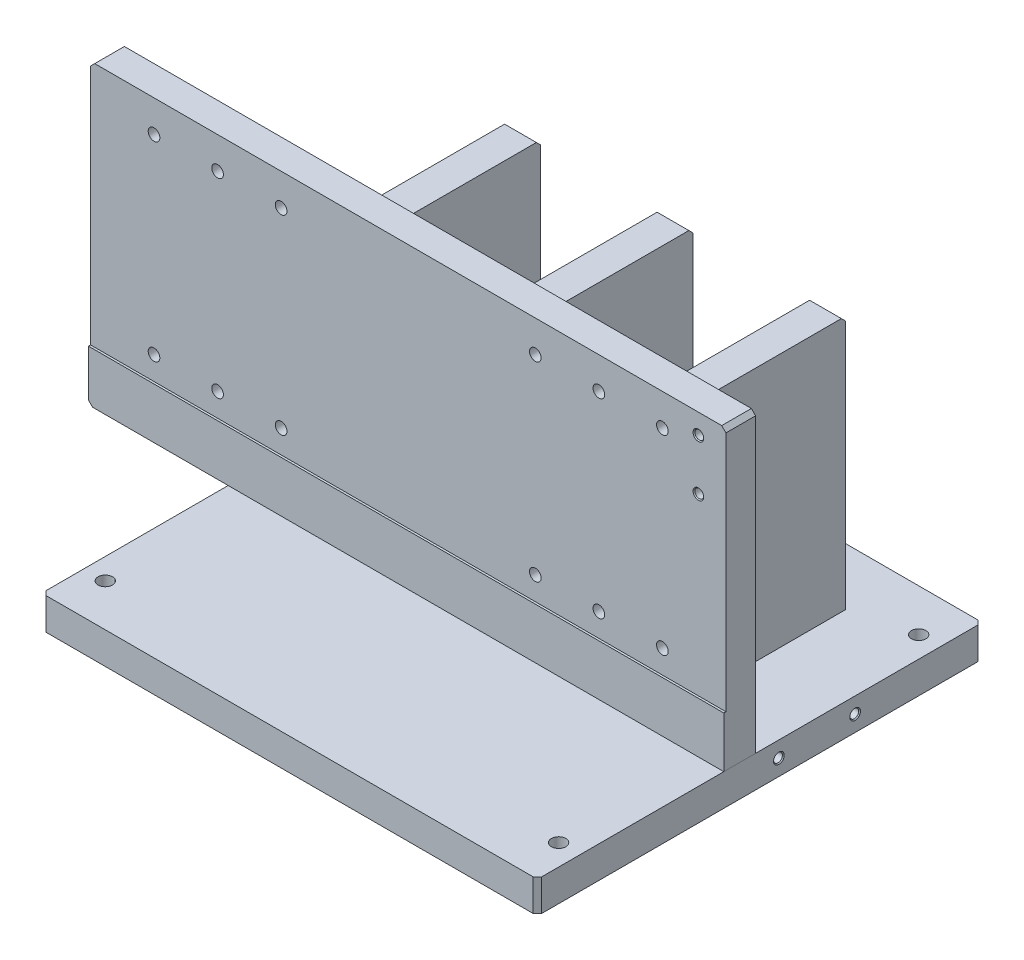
from build123d import *

# Parameters (mm, degrees)
SKETCH_1_W                    = 234
SKETCH_1_H                    = 210
EXTRUDE_1_DEPTH               = 15
SKETCH_2_W                    = 300
SKETCH_2_H                    = 15
EXTRUDE_2_DEPTH               = 140
SKETCH_3_W                    = 300
SKETCH_3_H                    = 116
CUT_EXTRUDE_1_DEPTH           = 1
SKETCH_4_W                    = 15
SKETCH_4_H                    = 80
EXTRUDE_3_DEPTH               = 120
EXTRUDE_3_2_DEPTH             = 120
EXTRUDE_3_3_DEPTH             = 120
CUT_EXTRUDE_2_DEPTH           = 272.407903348
SKETCH_9_W                    = 3.4
SKETCH_9_H                    = 15
HOLE_WIZARD_M8_1_AT_2_COUNT   = 2
HOLE_WIZARD_M8_1_AT_2_PITCH   = 214
HOLE_WIZARD_M8_1_AT_3_COUNT   = 2
HOLE_WIZARD_M8_1_AT_3_PITCH   = 170
HOLE_WIZARD_M8_1_AT_4_COUNT   = 2
HOLE_WIZARD_M8_1_AT_4_PITCH   = 273.305689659
F_6_0MM_1_AT_2_COUNT          = 2
F_6_0MM_1_AT_2_PITCH          = 214
HOLE_WIZARD_M5_1_AT_2_COUNT   = 2
HOLE_WIZARD_M5_1_AT_2_PITCH   = 30
HOLE_WIZARD_M5_1_AT_3_COUNT   = 2
HOLE_WIZARD_M5_1_AT_3_PITCH   = 60
HOLE_WIZARD_M5_1_AT_4_COUNT   = 2
HOLE_WIZARD_M5_1_AT_4_PITCH   = 90
HOLE_WIZARD_M5_1_AT_5_COUNT   = 2
HOLE_WIZARD_M5_1_AT_5_PITCH   = 108.166538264
HOLE_WIZARD_M5_1_AT_6_COUNT   = 2
HOLE_WIZARD_M5_1_AT_6_PITCH   = 94.868329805
PATTERN_LINEAR_1_COUNT        = 2
PATTERN_LINEAR_1_PITCH        = 180
HOLE_WIZARD_M5_1_2_AT_2_COUNT = 2
HOLE_WIZARD_M5_1_2_AT_2_PITCH = 24
HOLE_WIZARD_M5_2_AT_2_COUNT   = 2
HOLE_WIZARD_M5_2_AT_2_PITCH   = 36
CHAMFER_1_SIZE                = 2
CHAMFER_2_SIZE                = 2


with BuildPart() as part:
    # Sketch 1 → Extrude 1 (new body)
    with BuildSketch(Plane(origin=(0, 0, 0), x_dir=(1, 0, 0), z_dir=(0, 1, 0))):
        Rectangle(SKETCH_1_W, SKETCH_1_H)
    extrude(amount=EXTRUDE_1_DEPTH)

    # Sketch 9 → Hole Wizard M8 _ _1 (revolve, cut)
    with BuildSketch(Plane(origin=(-107, 15, -85), x_dir=(0, 0, 1), z_dir=(1, 0, 0))):
        with Locations((1.7, 7.5)):
            Rectangle(SKETCH_9_W, SKETCH_9_H)
    hole_wizard_m8_1 = revolve(axis=Axis((-107, 21.35, -85), (0, -1, 0)), mode=Mode.SUBTRACT)

    # Hole Wizard M8 _ _1 at 2: Hole Wizard M8 _ _1 ×2
    with Locations(*[(i * HOLE_WIZARD_M8_1_AT_2_PITCH, 0, 0) for i in range(1, HOLE_WIZARD_M8_1_AT_2_COUNT)]):
        add(hole_wizard_m8_1, mode=Mode.SUBTRACT)

    # Hole Wizard M8 _ _1 at 3: Hole Wizard M8 _ _1 ×2
    with Locations(*[(0, 0, i * HOLE_WIZARD_M8_1_AT_3_PITCH) for i in range(1, HOLE_WIZARD_M8_1_AT_3_COUNT)]):
        add(hole_wizard_m8_1, mode=Mode.SUBTRACT)

    # Hole Wizard M8 _ _1 at 4: Hole Wizard M8 _ _1 ×2
    with Locations(*[Vector(0.7830060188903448, 0, 0.6220141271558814) * (i * HOLE_WIZARD_M8_1_AT_4_PITCH) for i in range(1, HOLE_WIZARD_M8_1_AT_4_COUNT)]):
        add(hole_wizard_m8_1, mode=Mode.SUBTRACT)

    # Sketch 11 → 6.0mm _ _1 (revolve, cut)
    with BuildSketch(Plane(origin=(-107, 0, 0), x_dir=(0, 0, -1), z_dir=(1, 0, 0))):
        Polygon((0, 0), (0, 11.802581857), (3, 10), (3, 0), align=None)
    f_6_0mm_1 = revolve(axis=Axis((-107, -6.35, 0), (0, 1, 0)), mode=Mode.SUBTRACT)

    # 6.0mm _ _1 at 2: 6.0mm _ _1 ×2
    with Locations(*[(i * F_6_0MM_1_AT_2_PITCH, 0, 0) for i in range(1, F_6_0MM_1_AT_2_COUNT)]):
        add(f_6_0mm_1, mode=Mode.SUBTRACT)

    # Sketch 17 → Hole Wizard M5 _ _2 (revolve, cut)
    with BuildSketch(Plane(origin=(117, 7.5, -9), x_dir=(0, 0, -1), z_dir=(0, 1, 0))):
        Polygon((0, 0), (0, 13.2618073), (2.1, 12), (2.1, 0.425), (2.525, 0), align=None)
    hole_wizard_m5_2 = revolve(axis=Axis((123.35, 7.5, -9), (-1, 0, 0)), mode=Mode.SUBTRACT)

    # Hole Wizard M5 _ _2 at 2: Hole Wizard M5 _ _2 ×2
    with Locations(*[(0, 0, -i * HOLE_WIZARD_M5_2_AT_2_PITCH) for i in range(1, HOLE_WIZARD_M5_2_AT_2_COUNT)]):
        add(hole_wizard_m5_2, mode=Mode.SUBTRACT)

    # Chamfer 2
    chamfer_2_edges = [part.edges().sort_by_distance(p)[0] for p in [
        (117, 7.5, 105),
        (-117, 7.5, 105),
        (-117, 7.5, -105),
        (117, 7.5, -105),
    ]]
    chamfer(chamfer_2_edges, length=CHAMFER_2_SIZE)


with BuildPart() as body_2:
    # Sketch 2 → Extrude 2 (new body)
    with BuildSketch(Plane(origin=(0, 15, 0), x_dir=(1, 0, 0), z_dir=(0, 1, 0))):
        with Locations((-33, -9.5)):
            Rectangle(SKETCH_2_W, SKETCH_2_H)
    extrude(amount=EXTRUDE_2_DEPTH)

    # Sketch 3 → Cut-Extrude 1 (cut)
    with BuildSketch(Plane.XY.offset(17)):
        with Locations((-33, 97)):
            Rectangle(SKETCH_3_W, SKETCH_3_H)
    extrude(amount=-CUT_EXTRUDE_1_DEPTH, mode=Mode.SUBTRACT)

    # Sketch 13 → Hole Wizard M5 _ _ _ _ _1 (revolve, cut)
    with BuildSketch(Plane(origin=(87, 140, 2), x_dir=(0, 1, 0), z_dir=(1, 0, 0))):
        Polygon((0, 0), (0, 103), (2.75, 103), (2.75, 7), (4.75, 7), (4.75, 0), align=None)
    hole_wizard_m5_1 = revolve(axis=Axis((87, 140, -4.35), (0, 0, 1)), mode=Mode.SUBTRACT)

    # Hole Wizard M5 _ _ _ _ _1 at 2: Hole Wizard M5 _ _ _ _ _1 ×2
    with Locations(*[(-i * HOLE_WIZARD_M5_1_AT_2_PITCH, 0, 0) for i in range(1, HOLE_WIZARD_M5_1_AT_2_COUNT)]):
        add(hole_wizard_m5_1, mode=Mode.SUBTRACT)

    # Hole Wizard M5 _ _ _ _ _1 at 3: Hole Wizard M5 _ _ _ _ _1 ×2
    with Locations(*[(-i * HOLE_WIZARD_M5_1_AT_3_PITCH, 0, 0) for i in range(1, HOLE_WIZARD_M5_1_AT_3_COUNT)]):
        add(hole_wizard_m5_1, mode=Mode.SUBTRACT)

    # Hole Wizard M5 _ _ _ _ _1 at 4: Hole Wizard M5 _ _ _ _ _1 ×2
    with Locations(*[(0, -i * HOLE_WIZARD_M5_1_AT_4_PITCH, 0) for i in range(1, HOLE_WIZARD_M5_1_AT_4_COUNT)]):
        add(hole_wizard_m5_1, mode=Mode.SUBTRACT)

    # Hole Wizard M5 _ _ _ _ _1 at 5: Hole Wizard M5 _ _ _ _ _1 ×2
    with Locations(*[Vector(-0.5547001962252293, -0.8320502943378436, 0) * (i * HOLE_WIZARD_M5_1_AT_5_PITCH) for i in range(1, HOLE_WIZARD_M5_1_AT_5_COUNT)]):
        add(hole_wizard_m5_1, mode=Mode.SUBTRACT)

    # Hole Wizard M5 _ _ _ _ _1 at 6: Hole Wizard M5 _ _ _ _ _1 ×2
    with Locations(*[Vector(-0.3162277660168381, -0.9486832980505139, 0) * (i * HOLE_WIZARD_M5_1_AT_6_PITCH) for i in range(1, HOLE_WIZARD_M5_1_AT_6_COUNT)]):
        add(hole_wizard_m5_1, mode=Mode.SUBTRACT)

    # Pattern Linear 1: Hole Wizard M5 _ _ _ _ _1 ×2
    with Locations(*[(-i * PATTERN_LINEAR_1_PITCH, 0, 0) for i in range(1, PATTERN_LINEAR_1_COUNT)]):
        add(hole_wizard_m5_1, mode=Mode.SUBTRACT)

    # Pattern Linear 1 copy 1 sketch → Pattern Linear 1 copy 1 (revolve, cut)
    with BuildSketch(Plane(origin=(-123, 140, 2), x_dir=(0, 1, 0), z_dir=(1, 0, 0))):
        Polygon((0, 0), (0, 103), (2.75, 103), (2.75, 7), (4.75, 7), (4.75, 0), align=None)
    revolve(axis=Axis((-123, 140, -4.35), (0, 0, 1)), mode=Mode.SUBTRACT)

    # Pattern Linear 1 copy 2 sketch → Pattern Linear 1 copy 2 (revolve, cut)
    with BuildSketch(Plane(origin=(-153, 140, 2), x_dir=(0, 1, 0), z_dir=(1, 0, 0))):
        Polygon((0, 0), (0, 103), (2.75, 103), (2.75, 7), (4.75, 7), (4.75, 0), align=None)
    revolve(axis=Axis((-153, 140, -4.35), (0, 0, 1)), mode=Mode.SUBTRACT)

    # Pattern Linear 1 copy 3 sketch → Pattern Linear 1 copy 3 (revolve, cut)
    with BuildSketch(Plane(origin=(-93, 50, 2), x_dir=(0, 1, 0), z_dir=(1, 0, 0))):
        Polygon((0, 0), (0, 103), (2.75, 103), (2.75, 7), (4.75, 7), (4.75, 0), align=None)
    revolve(axis=Axis((-93, 50, -4.35), (0, 0, 1)), mode=Mode.SUBTRACT)

    # Pattern Linear 1 copy 4 sketch → Pattern Linear 1 copy 4 (revolve, cut)
    with BuildSketch(Plane(origin=(-153, 50, 2), x_dir=(0, 1, 0), z_dir=(1, 0, 0))):
        Polygon((0, 0), (0, 103), (2.75, 103), (2.75, 7), (4.75, 7), (4.75, 0), align=None)
    revolve(axis=Axis((-153, 50, -4.35), (0, 0, 1)), mode=Mode.SUBTRACT)

    # Pattern Linear 1 copy 5 sketch → Pattern Linear 1 copy 5 (revolve, cut)
    with BuildSketch(Plane(origin=(-123, 50, 2), x_dir=(0, 1, 0), z_dir=(1, 0, 0))):
        Polygon((0, 0), (0, 103), (2.75, 103), (2.75, 7), (4.75, 7), (4.75, 0), align=None)
    revolve(axis=Axis((-123, 50, -4.35), (0, 0, 1)), mode=Mode.SUBTRACT)

    # Sketch 15 → Hole Wizard M5 _ _1 2 (revolve, cut)
    with BuildSketch(Plane(origin=(104, 145.5, 16), x_dir=(0, -1, 0), z_dir=(1, 0, 0))):
        Polygon((0, 0), (0, 121), (2.525, 121), (2.1, 120.575), (2.1, 0.425), (2.525, 0), align=None)
    hole_wizard_m5_1_2 = revolve(axis=Axis((104, 145.5, 22.35), (0, 0, -1)), mode=Mode.SUBTRACT)

    # Hole Wizard M5 _ _1 2 at 2: Hole Wizard M5 _ _1 2 ×2
    with Locations(*[(0, -i * HOLE_WIZARD_M5_1_2_AT_2_PITCH, 0) for i in range(1, HOLE_WIZARD_M5_1_2_AT_2_COUNT)]):
        add(hole_wizard_m5_1_2, mode=Mode.SUBTRACT)

    # Chamfer 1
    chamfer_1_edges = [body_2.edges().sort_by_distance(p)[0] for p in [
        (-183, 155, 9),
        (117, 155, 9),
        (-183, 15, 9.5),
    ]]
    chamfer(chamfer_1_edges, length=CHAMFER_1_SIZE)


with BuildPart() as body_3:
    # Sketch 4 → Extrude 3 (new body)
    with BuildSketch(Plane(origin=(0, 15, 0), x_dir=(1, 0, 0), z_dir=(0, 1, 0))):
        with Locations((-72, 38)):
            Rectangle(SKETCH_4_W, SKETCH_4_H)
    extrude(amount=EXTRUDE_3_DEPTH)


with BuildPart() as body_4:
    # Sketch 4 → Extrude 3 2 (new body)
    with BuildSketch(Plane(origin=(0, 15, 0), x_dir=(1, 0, 0), z_dir=(0, 1, 0))):
        with Locations((0, 38)):
            Rectangle(SKETCH_4_W, SKETCH_4_H)
    extrude(amount=EXTRUDE_3_2_DEPTH)


with BuildPart() as body_5:
    # Sketch 4 → Extrude 3 3 (new body)
    with BuildSketch(Plane(origin=(0, 15, 0), x_dir=(1, 0, 0), z_dir=(0, 1, 0))):
        with Locations((72, 38)):
            Rectangle(SKETCH_4_W, SKETCH_4_H)
    extrude(amount=EXTRUDE_3_3_DEPTH)


with BuildPart() as cut_extrude_2_tool:
    # Sketch 5 → Cut-Extrude 2 (new, through all)
    with BuildSketch(Plane.ZY.offset(79.5)):
        Polygon((-78, 135), (-78, 133), (-76, 135), align=None)
    extrude(amount=-CUT_EXTRUDE_2_DEPTH)


with BuildPart() as body_3_1:
    add(body_3.part)

    # Cut-Extrude 2: cut by cut_extrude_2_tool
    add(cut_extrude_2_tool.part, mode=Mode.SUBTRACT)


with BuildPart() as body_4_1:
    add(body_4.part)

    # Cut-Extrude 2: cut by cut_extrude_2_tool
    add(cut_extrude_2_tool.part, mode=Mode.SUBTRACT)


with BuildPart() as body_5_1:
    add(body_5.part)

    # Cut-Extrude 2: cut by cut_extrude_2_tool
    add(cut_extrude_2_tool.part, mode=Mode.SUBTRACT)


solid = Compound([part.part, body_2.part, body_3_1.part, body_4_1.part, body_5_1.part])
